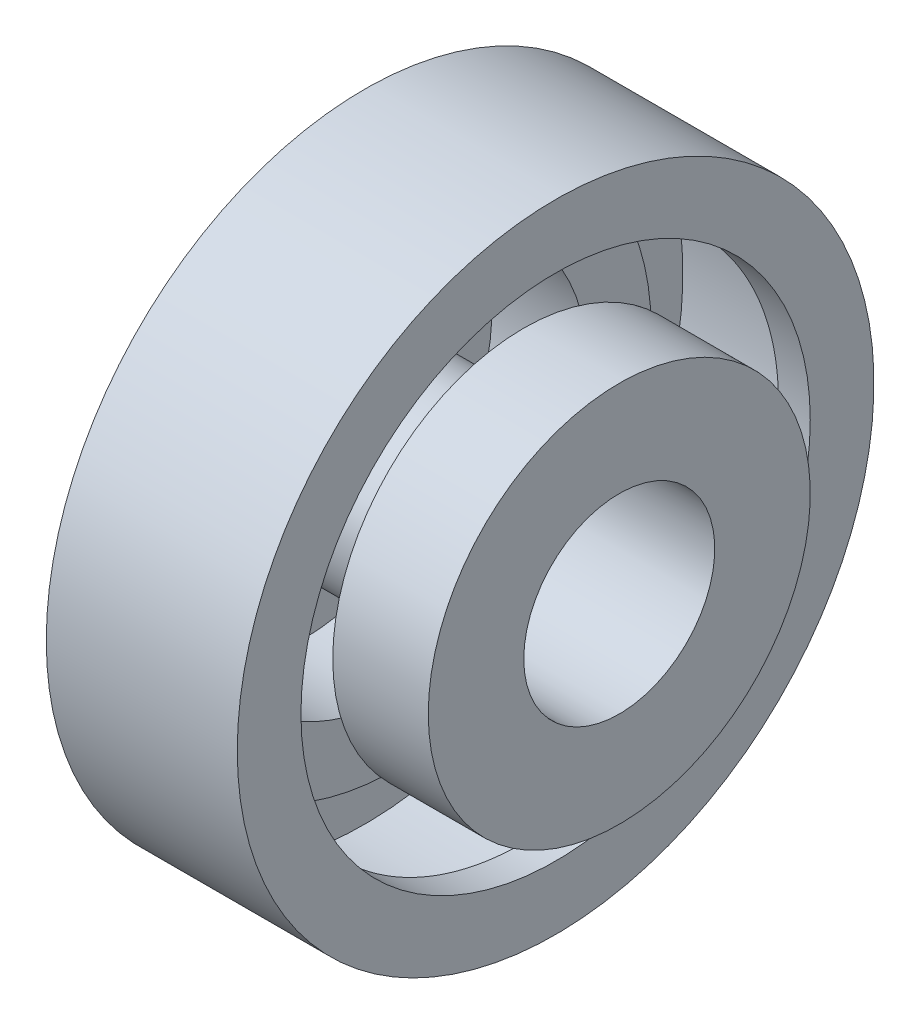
from build123d import *

# Parameters (mm, degrees)
SKETCH3_R      = 1
EXTRUDE2_DEPTH = 16.779733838


with BuildPart() as part:
    # Sketch1 → Revolve1 (revolve)
    with BuildSketch(Plane.XY, mode=Mode.PRIVATE) as revolve1_sk:
        Polygon((-5, 3), (5, 3), (5, 6), (2, 6), (2, 8), (3, 8), (3, 10), (-3, 10), (-3, 8), (-2, 8), (-2, 6), (-5, 6), align=None)
    revolve(revolve1_sk.sketch.rotate(Axis((-5.757546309, 0, 0), (1, 0, 0)), 90), axis=Axis((-5.757546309, 0, 0), (1, 0, 0)))

    # Sketch3 → Extrude2 (cut, through all)
    with BuildSketch(Plane(origin=(2, 0, 0), x_dir=(0, 0, -1), z_dir=(1, 0, 0))):
        with Locations(Location((7, 0, 0), (0, 0, 180.000750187))):
            Circle(SKETCH3_R)
    extrude(amount=-EXTRUDE2_DEPTH, mode=Mode.SUBTRACT)


solid = part.part
